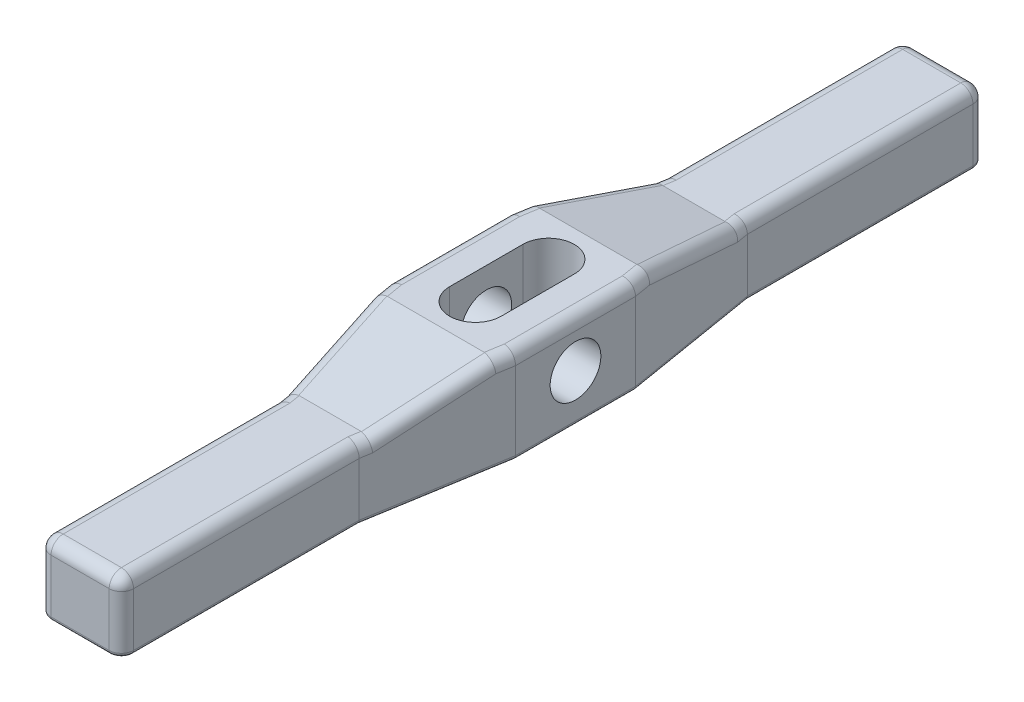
from build123d import *

# Parameters (mm, degrees)
EXTRUDE1_DEPTH     = 11.7602
CUT_EXTRUDE1_DEPTH = 58.477113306
SKETCH3_R          = 3.16865
CUT_EXTRUDE2_DEPTH = 58.477113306
FILLET1_R          = 1.524
FILLET2_R          = 0.508
FILLET3_R          = 1.524


with BuildPart() as part:
    # Sketch1 → Extrude1 (new body)
    with BuildSketch(Plane(origin=(0, 0, 0), x_dir=(1, 0, 0), z_dir=(0, 1, 0))):
        Polygon((-5.1562, 53.975), (5.1562, 53.975), (5.1562, 24.257), (7.9375, 7.496556), (7.9375, -7.496556), (5.1562, -24.257), (5.1562, -53.975), (-5.1562, -53.975), (-5.1562, -24.257), (-7.9375, -7.496556), (-7.9375, 7.496556), (-5.1562, 24.257), align=None)
        with BuildLine():
            Line((-3.2131, 4.572), (-3.2131, -4.572))
            ThreePointArc((-3.2131, -4.572), (0, -7.7851), (3.2131, -4.572))
            Line((3.2131, -4.572), (3.2131, 4.572))
            ThreePointArc((3.2131, 4.572), (0, 7.7851), (-3.2131, 4.572))
        make_face(mode=Mode.SUBTRACT)
    extrude(amount=EXTRUDE1_DEPTH)

    # Sketch2 → Cut-Extrude1 (cut, through all)
    with BuildSketch(Plane(origin=(7.9375, 0, 0), x_dir=(0, 0, -1), z_dir=(1, 0, 0))):
        Polygon((53.975, 11.7602), (9.525, 11.7602), (22.727338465, 8.7122), (53.975, 8.7122), align=None)
        Polygon((-53.975, 8.7122), (-53.975, 11.7602), (-9.525, 11.7602), (-22.727338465, 8.7122), align=None)
    extrude(amount=-CUT_EXTRUDE1_DEPTH, mode=Mode.SUBTRACT)

    # Sketch3 → Cut-Extrude2 (cut, through all)
    with BuildSketch(Plane(origin=(7.9375, 0, 0), x_dir=(0, 0, -1), z_dir=(1, 0, 0))):
        with Locations((0, 5.9436)):
            Circle(SKETCH3_R)
    extrude(amount=-CUT_EXTRUDE2_DEPTH, mode=Mode.SUBTRACT)

    # Fillet1
    fillet1_edges = [part.edges().sort_by_distance(p)[0] for p in [
        (-5.1562, 4.3561, -53.975),
        (5.1562, 4.3561, -53.975),
        (5.1562, 4.3561, 53.975),
        (-5.1562, 4.3561, 53.975),
    ]]
    fillet(fillet1_edges, radius=FILLET1_R)

    # Fillet2
    fillet2_edges = [part.edges().sort_by_distance(p)[0] for p in [
        (7.9375, 0, 0),
        (-5.1562, 0, -38.354),
        (6.54685, 0, 15.876778),
        (5.1562, 0, 38.354),
        (0, 0, 53.975),
        (0, 0, -53.975),
        (-4.709830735, 0, 53.528630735),
        (4.709830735, 0, 53.528630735),
        (4.709830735, 0, -53.528630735),
        (-4.709830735, 0, -53.528630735),
        (-5.1562, 0, 38.354),
        (-6.54685, 0, 15.876778),
        (-7.9375, 0, 0),
        (-6.54685, 0, -15.876778),
        (5.1562, 0, -38.354),
        (6.54685, 0, -15.876778),
    ]]
    fillet(fillet2_edges, radius=FILLET2_R)

    # Fillet3
    fillet3_edges = [part.edges().sort_by_distance(p)[0] for p in [
        (0, 8.7122, -53.975),
        (5.1562, 8.7122, -38.354),
        (4.709830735, 8.7122, -53.528630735),
        (-4.709830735, 8.7122, -53.528630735),
        (0, 8.7122, 53.975),
        (-5.1562, 8.7122, 38.354),
        (-4.709830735, 8.7122, 53.528630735),
        (4.709830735, 8.7122, 53.528630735),
        (-7.9375, 11.7602, 0),
        (-7.769195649, 11.7602, 8.510778),
        (7.9375, 11.7602, 0),
        (7.769195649, 11.7602, -8.510778),
        (6.505464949, 10.2362, -16.126169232),
        (5.2831193, 8.7122, -23.492169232),
        (-7.769195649, 11.7602, -8.510778),
        (-5.2831193, 8.7122, -23.492169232),
        (-5.1562, 8.7122, -38.354),
        (-6.505464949, 10.2362, -16.126169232),
        (7.769195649, 11.7602, 8.510778),
        (6.505464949, 10.2362, 16.126169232),
        (5.2831193, 8.7122, 23.492169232),
        (-5.2831193, 8.7122, 23.492169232),
        (5.1562, 8.7122, 38.354),
        (-6.505464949, 10.2362, 16.126169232),
    ]]
    fillet(fillet3_edges, radius=FILLET3_R)


solid = part.part
